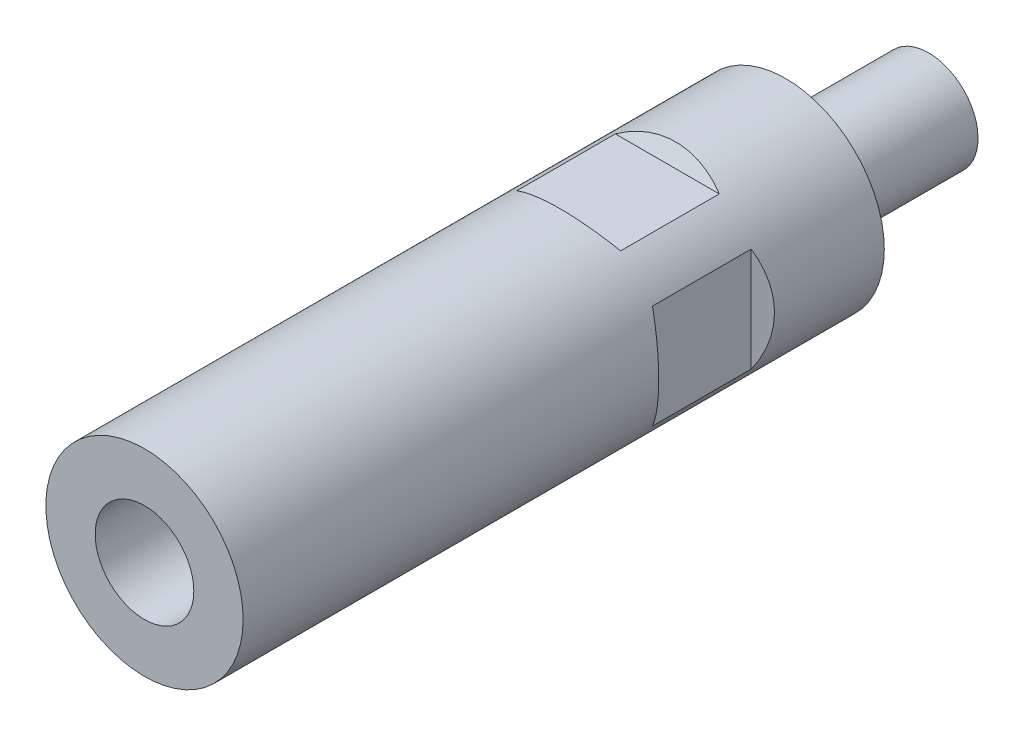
ISO-10303-21;
HEADER;
FILE_DESCRIPTION(('STEP AP214'),'2;1');
FILE_NAME('part.step','',(''),(''),'','','');
FILE_SCHEMA(('AUTOMOTIVE_DESIGN { 1 0 10303 214 1 1 1 1 }'));
ENDSEC;
DATA;
#1=APPLICATION_CONTEXT('core data for automotive mechanical design processes');
#2=APPLICATION_PROTOCOL_DEFINITION('international standard','automotive_design',2000,#1);
#3=PRODUCT_CONTEXT('',#1,'mechanical');
#4=PRODUCT('Part','Part','',(#3));
#5=PRODUCT_RELATED_PRODUCT_CATEGORY('part','',(#4));
#6=PRODUCT_DEFINITION_FORMATION('','',#4);
#7=PRODUCT_DEFINITION_CONTEXT('part definition',#1,'design');
#8=PRODUCT_DEFINITION('design','',#6,#7);
#9=PRODUCT_DEFINITION_SHAPE('','',#8);
#10=(LENGTH_UNIT() NAMED_UNIT(*) SI_UNIT(.MILLI.,.METRE.));
#11=(NAMED_UNIT(*) PLANE_ANGLE_UNIT() SI_UNIT($,.RADIAN.));
#12=(NAMED_UNIT(*) SI_UNIT($,.STERADIAN.) SOLID_ANGLE_UNIT());
#13=UNCERTAINTY_MEASURE_WITH_UNIT(LENGTH_MEASURE(1.E-05),#10,'distance_accuracy_value','');
#14=(GEOMETRIC_REPRESENTATION_CONTEXT(3) GLOBAL_UNCERTAINTY_ASSIGNED_CONTEXT((#13)) GLOBAL_UNIT_ASSIGNED_CONTEXT((#10,
#11,#12)) REPRESENTATION_CONTEXT('',''));
#15=CARTESIAN_POINT('',(0.,0.,0.));
#16=DIRECTION('',(0.,0.,1.));
#17=DIRECTION('',(1.,0.,0.));
#18=AXIS2_PLACEMENT_3D('',#15,#16,#17);
#19=CARTESIAN_POINT('',(0.,0.,5.5));
#20=DIRECTION('',(0.,0.,1.));
#21=DIRECTION('',(0.,-1.,0.));
#22=AXIS2_PLACEMENT_3D('',#19,#20,#21);
#23=CYLINDRICAL_SURFACE('',#22,5.);
#24=CARTESIAN_POINT('',(0.,0.,-14.5));
#25=DIRECTION('',(0.,0.,1.));
#26=DIRECTION('',(0.,-1.,0.));
#27=AXIS2_PLACEMENT_3D('',#24,#25,#26);
#28=CIRCLE('',#27,5.);
#29=CARTESIAN_POINT('',(0.,-5.,-14.5));
#30=VERTEX_POINT('',#29);
#31=EDGE_CURVE('E22',#30,#30,#28,.F.);
#32=ORIENTED_EDGE('',*,*,#31,.F.);
#33=EDGE_LOOP('',(#32));
#34=FACE_BOUND('',#33,.T.);
#35=CARTESIAN_POINT('',(0.,0.,0.));
#36=DIRECTION('',(0.,0.,1.));
#37=DIRECTION('',(1.,0.,0.));
#38=AXIS2_PLACEMENT_3D('',#35,#36,#37);
#39=CIRCLE('',#38,5.);
#40=CARTESIAN_POINT('',(5.,0.,0.));
#41=VERTEX_POINT('',#40);
#42=EDGE_CURVE('E9',#41,#41,#39,.T.);
#43=ORIENTED_EDGE('',*,*,#42,.F.);
#44=EDGE_LOOP('',(#43));
#45=FACE_BOUND('',#44,.T.);
#46=ADVANCED_FACE('F14',(#34,#45),#23,.T.);
#47=CARTESIAN_POINT('',(0.,0.,-14.5));
#48=DIRECTION('',(0.,0.,1.));
#49=DIRECTION('',(0.,-1.,0.));
#50=AXIS2_PLACEMENT_3D('',#47,#48,#49);
#51=PLANE('',#50);
#52=ORIENTED_EDGE('',*,*,#31,.T.);
#53=EDGE_LOOP('',(#52));
#54=FACE_BOUND('',#53,.T.);
#55=ADVANCED_FACE('F16',(#54),#51,.F.);
#56=CARTESIAN_POINT('',(4.25,4.36432032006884E-13,40.));
#57=DIRECTION('',(0.,0.,-1.));
#58=DIRECTION('',(-1.,0.,0.));
#59=AXIS2_PLACEMENT_3D('',#56,#57,#58);
#60=PLANE('',#59);
#61=CARTESIAN_POINT('',(0.,4.36432032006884E-13,40.));
#62=DIRECTION('',(0.,0.,1.));
#63=DIRECTION('',(1.,0.,0.));
#64=AXIS2_PLACEMENT_3D('',#61,#62,#63);
#65=CIRCLE('',#64,5.);
#66=CARTESIAN_POINT('',(5.,4.36432032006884E-13,40.));
#67=VERTEX_POINT('',#66);
#68=EDGE_CURVE('E251',#67,#67,#65,.T.);
#69=ORIENTED_EDGE('',*,*,#68,.T.);
#70=EDGE_LOOP('',(#69));
#71=FACE_BOUND('',#70,.T.);
#72=ADVANCED_FACE('F125',(#71),#60,.F.);
#73=CARTESIAN_POINT('',(0.,4.36432032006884E-13,65.));
#74=DIRECTION('',(0.,0.,1.));
#75=DIRECTION('',(1.,0.,0.));
#76=AXIS2_PLACEMENT_3D('',#73,#74,#75);
#77=CYLINDRICAL_SURFACE('',#76,5.);
#78=ORIENTED_EDGE('',*,*,#68,.F.);
#79=EDGE_LOOP('',(#78));
#80=FACE_BOUND('',#79,.T.);
#81=CARTESIAN_POINT('',(0.,4.36432032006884E-13,65.));
#82=DIRECTION('',(0.,0.,1.));
#83=DIRECTION('',(1.,0.,0.));
#84=AXIS2_PLACEMENT_3D('',#81,#82,#83);
#85=CIRCLE('',#84,5.);
#86=CARTESIAN_POINT('',(5.,4.36432032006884E-13,65.));
#87=VERTEX_POINT('',#86);
#88=EDGE_CURVE('E96',#87,#87,#85,.T.);
#89=ORIENTED_EDGE('',*,*,#88,.T.);
#90=EDGE_LOOP('',(#89));
#91=FACE_BOUND('',#90,.T.);
#92=ADVANCED_FACE('F127',(#80,#91),#77,.F.);
#93=CARTESIAN_POINT('',(0.,0.,65.));
#94=DIRECTION('',(0.,0.,1.));
#95=DIRECTION('',(1.,0.,0.));
#96=AXIS2_PLACEMENT_3D('',#93,#94,#95);
#97=PLANE('',#96);
#98=ORIENTED_EDGE('',*,*,#88,.F.);
#99=EDGE_LOOP('',(#98));
#100=FACE_BOUND('',#99,.T.);
#101=CARTESIAN_POINT('',(0.,0.,65.));
#102=DIRECTION('',(0.,0.,1.));
#103=DIRECTION('',(1.,0.,0.));
#104=AXIS2_PLACEMENT_3D('',#101,#102,#103);
#105=CIRCLE('',#104,10.);
#106=CARTESIAN_POINT('',(10.,0.,65.));
#107=VERTEX_POINT('',#106);
#108=EDGE_CURVE('E239',#107,#107,#105,.T.);
#109=ORIENTED_EDGE('',*,*,#108,.T.);
#110=EDGE_LOOP('',(#109));
#111=FACE_BOUND('',#110,.T.);
#112=ADVANCED_FACE('F134',(#100,#111),#97,.T.);
#113=CARTESIAN_POINT('',(8.5,-10.,22.));
#114=DIRECTION('',(-0.5,0.,0.866025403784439));
#115=DIRECTION('',(0.866025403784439,0.,0.5));
#116=AXIS2_PLACEMENT_3D('',#113,#114,#115);
#117=PLANE('',#116);
#118=DIRECTION('',(0.,1.,0.));
#119=VECTOR('',#118,1.);
#120=CARTESIAN_POINT('',(8.5,-10.,22.));
#121=LINE('',#120,#119);
#122=CARTESIAN_POINT('',(8.5,-5.26782687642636,22.));
#123=VERTEX_POINT('',#122);
#124=CARTESIAN_POINT('',(8.5,5.26782687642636,22.));
#125=VERTEX_POINT('',#124);
#126=EDGE_CURVE('E183',#123,#125,#121,.T.);
#127=ORIENTED_EDGE('',*,*,#126,.T.);
#128=CARTESIAN_POINT('',(0.,0.,17.0925227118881));
#129=DIRECTION('',(-0.5,0.,0.866025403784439));
#130=DIRECTION('',(-0.866025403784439,0.,-0.5));
#131=AXIS2_PLACEMENT_3D('',#128,#129,#130);
#132=ELLIPSE('',#131,11.5470053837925,10.);
#133=EDGE_CURVE('E35',#123,#125,#132,.T.);
#134=ORIENTED_EDGE('',*,*,#133,.F.);
#135=EDGE_LOOP('',(#127,#134));
#136=FACE_BOUND('',#135,.T.);
#137=ADVANCED_FACE('F175',(#136),#117,.F.);
#138=CARTESIAN_POINT('',(8.5,-10.,22.));
#139=DIRECTION('',(-1.,0.,0.));
#140=DIRECTION('',(0.,0.,1.));
#141=AXIS2_PLACEMENT_3D('',#138,#139,#140);
#142=PLANE('',#141);
#143=ORIENTED_EDGE('',*,*,#126,.F.);
#144=DIRECTION('',(0.,0.,-1.));
#145=VECTOR('',#144,1.);
#146=CARTESIAN_POINT('',(8.5,-5.26782687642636,65.));
#147=LINE('',#146,#145);
#148=CARTESIAN_POINT('',(8.5,-5.26782687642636,12.));
#149=VERTEX_POINT('',#148);
#150=EDGE_CURVE('E191',#149,#123,#147,.F.);
#151=ORIENTED_EDGE('',*,*,#150,.F.);
#152=DIRECTION('',(0.,1.,0.));
#153=VECTOR('',#152,1.);
#154=CARTESIAN_POINT('',(8.5,-10.,12.));
#155=LINE('',#154,#153);
#156=CARTESIAN_POINT('',(8.5,5.26782687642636,12.));
#157=VERTEX_POINT('',#156);
#158=EDGE_CURVE('E187',#149,#157,#155,.T.);
#159=ORIENTED_EDGE('',*,*,#158,.T.);
#160=DIRECTION('',(0.,0.,-1.));
#161=VECTOR('',#160,1.);
#162=CARTESIAN_POINT('',(8.5,5.26782687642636,65.));
#163=LINE('',#162,#161);
#164=EDGE_CURVE('E29',#125,#157,#163,.T.);
#165=ORIENTED_EDGE('',*,*,#164,.F.);
#166=EDGE_LOOP('',(#143,#151,#159,#165));
#167=FACE_BOUND('',#166,.T.);
#168=ADVANCED_FACE('F172',(#167),#142,.F.);
#169=CARTESIAN_POINT('',(8.5,-10.,12.));
#170=DIRECTION('',(-0.5,0.,-0.866025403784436));
#171=DIRECTION('',(-0.866025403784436,0.,0.5));
#172=AXIS2_PLACEMENT_3D('',#169,#170,#171);
#173=PLANE('',#172);
#174=CARTESIAN_POINT('',(0.,0.,16.9074772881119));
#175=DIRECTION('',(-0.5,0.,-0.866025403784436));
#176=DIRECTION('',(0.866025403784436,0.,-0.5));
#177=AXIS2_PLACEMENT_3D('',#174,#175,#176);
#178=ELLIPSE('',#177,11.5470053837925,10.);
#179=EDGE_CURVE('E195',#157,#149,#178,.T.);
#180=ORIENTED_EDGE('',*,*,#179,.F.);
#181=ORIENTED_EDGE('',*,*,#158,.F.);
#182=EDGE_LOOP('',(#180,#181));
#183=FACE_BOUND('',#182,.T.);
#184=ADVANCED_FACE('F167',(#183),#173,.F.);
#185=CARTESIAN_POINT('',(-8.5,-10.,12.));
#186=DIRECTION('',(0.5,0.,-0.866025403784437));
#187=DIRECTION('',(-0.866025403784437,0.,-0.5));
#188=AXIS2_PLACEMENT_3D('',#185,#186,#187);
#189=PLANE('',#188);
#190=CARTESIAN_POINT('',(0.,0.,16.9074772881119));
#191=DIRECTION('',(0.5,0.,-0.866025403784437));
#192=DIRECTION('',(-0.866025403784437,0.,-0.5));
#193=AXIS2_PLACEMENT_3D('',#190,#191,#192);
#194=ELLIPSE('',#193,11.5470053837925,10.);
#195=CARTESIAN_POINT('',(-8.5,-5.26782687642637,12.));
#196=VERTEX_POINT('',#195);
#197=CARTESIAN_POINT('',(-8.5,5.26782687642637,12.));
#198=VERTEX_POINT('',#197);
#199=EDGE_CURVE('E193',#196,#198,#194,.T.);
#200=ORIENTED_EDGE('',*,*,#199,.F.);
#201=DIRECTION('',(0.,1.,0.));
#202=VECTOR('',#201,1.);
#203=CARTESIAN_POINT('',(-8.5,-10.,12.));
#204=LINE('',#203,#202);
#205=EDGE_CURVE('E227',#196,#198,#204,.T.);
#206=ORIENTED_EDGE('',*,*,#205,.T.);
#207=EDGE_LOOP('',(#200,#206));
#208=FACE_BOUND('',#207,.T.);
#209=ADVANCED_FACE('F163',(#208),#189,.F.);
#210=CARTESIAN_POINT('',(-8.5,-10.,22.));
#211=DIRECTION('',(0.5,0.,0.866025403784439));
#212=DIRECTION('',(0.866025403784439,0.,-0.5));
#213=AXIS2_PLACEMENT_3D('',#210,#211,#212);
#214=PLANE('',#213);
#215=DIRECTION('',(0.,1.,0.));
#216=VECTOR('',#215,1.);
#217=CARTESIAN_POINT('',(-8.5,-10.,22.));
#218=LINE('',#217,#216);
#219=CARTESIAN_POINT('',(-8.5,-5.26782687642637,22.));
#220=VERTEX_POINT('',#219);
#221=CARTESIAN_POINT('',(-8.5,5.26782687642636,22.));
#222=VERTEX_POINT('',#221);
#223=EDGE_CURVE('E231',#220,#222,#218,.T.);
#224=ORIENTED_EDGE('',*,*,#223,.F.);
#225=CARTESIAN_POINT('',(0.,0.,17.0925227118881));
#226=DIRECTION('',(0.5,0.,0.866025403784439));
#227=DIRECTION('',(0.866025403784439,0.,-0.5));
#228=AXIS2_PLACEMENT_3D('',#225,#226,#227);
#229=ELLIPSE('',#228,11.5470053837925,10.);
#230=EDGE_CURVE('E206',#222,#220,#229,.T.);
#231=ORIENTED_EDGE('',*,*,#230,.F.);
#232=EDGE_LOOP('',(#224,#231));
#233=FACE_BOUND('',#232,.T.);
#234=ADVANCED_FACE('F160',(#233),#214,.F.);
#235=CARTESIAN_POINT('',(-8.5,-10.,22.));
#236=DIRECTION('',(1.,0.,0.));
#237=DIRECTION('',(0.,0.,-1.));
#238=AXIS2_PLACEMENT_3D('',#235,#236,#237);
#239=PLANE('',#238);
#240=ORIENTED_EDGE('',*,*,#223,.T.);
#241=DIRECTION('',(0.,0.,-1.));
#242=VECTOR('',#241,1.);
#243=CARTESIAN_POINT('',(-8.5,5.2678268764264,65.));
#244=LINE('',#243,#242);
#245=EDGE_CURVE('E200',#198,#222,#244,.F.);
#246=ORIENTED_EDGE('',*,*,#245,.F.);
#247=ORIENTED_EDGE('',*,*,#205,.F.);
#248=DIRECTION('',(0.,0.,-1.));
#249=VECTOR('',#248,1.);
#250=CARTESIAN_POINT('',(-8.5,-5.2678268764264,65.));
#251=LINE('',#250,#249);
#252=EDGE_CURVE('E203',#220,#196,#251,.T.);
#253=ORIENTED_EDGE('',*,*,#252,.F.);
#254=EDGE_LOOP('',(#240,#246,#247,#253));
#255=FACE_BOUND('',#254,.T.);
#256=ADVANCED_FACE('F158',(#255),#239,.F.);
#257=CARTESIAN_POINT('',(10.,8.5,22.));
#258=DIRECTION('',(0.,-0.5,0.866025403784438));
#259=DIRECTION('',(0.,-0.866025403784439,-0.5));
#260=AXIS2_PLACEMENT_3D('',#257,#258,#259);
#261=PLANE('',#260);
#262=DIRECTION('',(-1.,0.,0.));
#263=VECTOR('',#262,1.);
#264=CARTESIAN_POINT('',(10.,8.5,22.));
#265=LINE('',#264,#263);
#266=CARTESIAN_POINT('',(5.26782687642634,8.5,22.));
#267=VERTEX_POINT('',#266);
#268=CARTESIAN_POINT('',(-5.26782687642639,8.5,22.));
#269=VERTEX_POINT('',#268);
#270=EDGE_CURVE('E225',#267,#269,#265,.T.);
#271=ORIENTED_EDGE('',*,*,#270,.T.);
#272=CARTESIAN_POINT('',(0.,0.,17.0925227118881));
#273=DIRECTION('',(0.,-0.5,0.866025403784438));
#274=DIRECTION('',(0.,-0.866025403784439,-0.5));
#275=AXIS2_PLACEMENT_3D('',#272,#273,#274);
#276=ELLIPSE('',#275,11.5470053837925,10.);
#277=EDGE_CURVE('E214',#267,#269,#276,.T.);
#278=ORIENTED_EDGE('',*,*,#277,.F.);
#279=EDGE_LOOP('',(#271,#278));
#280=FACE_BOUND('',#279,.T.);
#281=ADVANCED_FACE('F151',(#280),#261,.F.);
#282=CARTESIAN_POINT('',(10.,8.5,22.));
#283=DIRECTION('',(0.,-1.,0.));
#284=DIRECTION('',(1.,0.,0.));
#285=AXIS2_PLACEMENT_3D('',#282,#283,#284);
#286=PLANE('',#285);
#287=ORIENTED_EDGE('',*,*,#270,.F.);
#288=DIRECTION('',(0.,0.,-1.));
#289=VECTOR('',#288,1.);
#290=CARTESIAN_POINT('',(5.26782687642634,8.5,65.));
#291=LINE('',#290,#289);
#292=CARTESIAN_POINT('',(5.26782687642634,8.5,12.));
#293=VERTEX_POINT('',#292);
#294=EDGE_CURVE('E88',#293,#267,#291,.F.);
#295=ORIENTED_EDGE('',*,*,#294,.F.);
#296=DIRECTION('',(-1.,0.,0.));
#297=VECTOR('',#296,1.);
#298=CARTESIAN_POINT('',(10.,8.5,12.));
#299=LINE('',#298,#297);
#300=CARTESIAN_POINT('',(-5.26782687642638,8.5,12.));
#301=VERTEX_POINT('',#300);
#302=EDGE_CURVE('E223',#293,#301,#299,.T.);
#303=ORIENTED_EDGE('',*,*,#302,.T.);
#304=DIRECTION('',(0.,0.,-1.));
#305=VECTOR('',#304,1.);
#306=CARTESIAN_POINT('',(-5.2678268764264,8.5,65.));
#307=LINE('',#306,#305);
#308=EDGE_CURVE('E211',#269,#301,#307,.T.);
#309=ORIENTED_EDGE('',*,*,#308,.F.);
#310=EDGE_LOOP('',(#287,#295,#303,#309));
#311=FACE_BOUND('',#310,.T.);
#312=ADVANCED_FACE('F148',(#311),#286,.F.);
#313=CARTESIAN_POINT('',(10.,8.5,12.));
#314=DIRECTION('',(0.,-0.5,-0.866025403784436));
#315=DIRECTION('',(0.,0.866025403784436,-0.5));
#316=AXIS2_PLACEMENT_3D('',#313,#314,#315);
#317=PLANE('',#316);
#318=CARTESIAN_POINT('',(0.,0.,16.9074772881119));
#319=DIRECTION('',(0.,-0.5,-0.866025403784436));
#320=DIRECTION('',(0.,0.866025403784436,-0.5));
#321=AXIS2_PLACEMENT_3D('',#318,#319,#320);
#322=ELLIPSE('',#321,11.5470053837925,10.);
#323=EDGE_CURVE('E209',#301,#293,#322,.T.);
#324=ORIENTED_EDGE('',*,*,#323,.F.);
#325=ORIENTED_EDGE('',*,*,#302,.F.);
#326=EDGE_LOOP('',(#324,#325));
#327=FACE_BOUND('',#326,.T.);
#328=ADVANCED_FACE('F145',(#327),#317,.F.);
#329=CARTESIAN_POINT('',(10.,-8.5,12.));
#330=DIRECTION('',(0.,0.5,-0.866025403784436));
#331=DIRECTION('',(0.,0.866025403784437,0.5));
#332=AXIS2_PLACEMENT_3D('',#329,#330,#331);
#333=PLANE('',#332);
#334=CARTESIAN_POINT('',(0.,0.,16.9074772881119));
#335=DIRECTION('',(0.,0.5,-0.866025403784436));
#336=DIRECTION('',(0.,-0.866025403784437,-0.5));
#337=AXIS2_PLACEMENT_3D('',#334,#335,#336);
#338=ELLIPSE('',#337,11.5470053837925,10.);
#339=CARTESIAN_POINT('',(5.26782687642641,-8.5,12.));
#340=VERTEX_POINT('',#339);
#341=CARTESIAN_POINT('',(-5.26782687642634,-8.5,12.));
#342=VERTEX_POINT('',#341);
#343=EDGE_CURVE('E79',#340,#342,#338,.T.);
#344=ORIENTED_EDGE('',*,*,#343,.F.);
#345=DIRECTION('',(-1.,0.,0.));
#346=VECTOR('',#345,1.);
#347=CARTESIAN_POINT('',(10.,-8.5,12.));
#348=LINE('',#347,#346);
#349=EDGE_CURVE('E82',#340,#342,#348,.T.);
#350=ORIENTED_EDGE('',*,*,#349,.T.);
#351=EDGE_LOOP('',(#344,#350));
#352=FACE_BOUND('',#351,.T.);
#353=ADVANCED_FACE('F81',(#352),#333,.F.);
#354=CARTESIAN_POINT('',(10.,-8.5,22.));
#355=DIRECTION('',(0.,0.5,0.866025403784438));
#356=DIRECTION('',(0.,-0.866025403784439,0.5));
#357=AXIS2_PLACEMENT_3D('',#354,#355,#356);
#358=PLANE('',#357);
#359=DIRECTION('',(-1.,0.,0.));
#360=VECTOR('',#359,1.);
#361=CARTESIAN_POINT('',(10.,-8.5,22.));
#362=LINE('',#361,#360);
#363=CARTESIAN_POINT('',(5.26782687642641,-8.5,22.));
#364=VERTEX_POINT('',#363);
#365=CARTESIAN_POINT('',(-5.26782687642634,-8.5,22.));
#366=VERTEX_POINT('',#365);
#367=EDGE_CURVE('E95',#364,#366,#362,.T.);
#368=ORIENTED_EDGE('',*,*,#367,.F.);
#369=CARTESIAN_POINT('',(0.,0.,17.0925227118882));
#370=DIRECTION('',(0.,0.5,0.866025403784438));
#371=DIRECTION('',(0.,0.866025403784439,-0.5));
#372=AXIS2_PLACEMENT_3D('',#369,#370,#371);
#373=ELLIPSE('',#372,11.5470053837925,10.);
#374=EDGE_CURVE('E101',#366,#364,#373,.T.);
#375=ORIENTED_EDGE('',*,*,#374,.F.);
#376=EDGE_LOOP('',(#368,#375));
#377=FACE_BOUND('',#376,.T.);
#378=ADVANCED_FACE('F139',(#377),#358,.F.);
#379=CARTESIAN_POINT('',(10.,-8.5,22.));
#380=DIRECTION('',(0.,1.,0.));
#381=DIRECTION('',(-1.,0.,0.));
#382=AXIS2_PLACEMENT_3D('',#379,#380,#381);
#383=PLANE('',#382);
#384=ORIENTED_EDGE('',*,*,#367,.T.);
#385=DIRECTION('',(0.,0.,-1.));
#386=VECTOR('',#385,1.);
#387=CARTESIAN_POINT('',(-5.26782687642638,-8.5,65.));
#388=LINE('',#387,#386);
#389=EDGE_CURVE('E87',#342,#366,#388,.F.);
#390=ORIENTED_EDGE('',*,*,#389,.F.);
#391=ORIENTED_EDGE('',*,*,#349,.F.);
#392=DIRECTION('',(0.,0.,-1.));
#393=VECTOR('',#392,1.);
#394=CARTESIAN_POINT('',(5.26782687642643,-8.5,65.));
#395=LINE('',#394,#393);
#396=EDGE_CURVE('E93',#364,#340,#395,.T.);
#397=ORIENTED_EDGE('',*,*,#396,.F.);
#398=EDGE_LOOP('',(#384,#390,#391,#397));
#399=FACE_BOUND('',#398,.T.);
#400=ADVANCED_FACE('F92',(#399),#383,.F.);
#401=CARTESIAN_POINT('',(0.,0.,65.));
#402=DIRECTION('',(0.,0.,-1.));
#403=DIRECTION('',(-1.,0.,0.));
#404=AXIS2_PLACEMENT_3D('',#401,#402,#403);
#405=CYLINDRICAL_SURFACE('',#404,10.);
#406=ORIENTED_EDGE('',*,*,#389,.T.);
#407=ORIENTED_EDGE('',*,*,#374,.T.);
#408=ORIENTED_EDGE('',*,*,#396,.T.);
#409=ORIENTED_EDGE('',*,*,#343,.T.);
#410=EDGE_LOOP('',(#406,#407,#408,#409));
#411=FACE_BOUND('',#410,.T.);
#412=ORIENTED_EDGE('',*,*,#323,.T.);
#413=ORIENTED_EDGE('',*,*,#294,.T.);
#414=ORIENTED_EDGE('',*,*,#277,.T.);
#415=ORIENTED_EDGE('',*,*,#308,.T.);
#416=EDGE_LOOP('',(#412,#413,#414,#415));
#417=FACE_BOUND('',#416,.T.);
#418=ORIENTED_EDGE('',*,*,#245,.T.);
#419=ORIENTED_EDGE('',*,*,#230,.T.);
#420=ORIENTED_EDGE('',*,*,#252,.T.);
#421=ORIENTED_EDGE('',*,*,#199,.T.);
#422=EDGE_LOOP('',(#418,#419,#420,#421));
#423=FACE_BOUND('',#422,.T.);
#424=ORIENTED_EDGE('',*,*,#179,.T.);
#425=ORIENTED_EDGE('',*,*,#150,.T.);
#426=ORIENTED_EDGE('',*,*,#133,.T.);
#427=ORIENTED_EDGE('',*,*,#164,.T.);
#428=EDGE_LOOP('',(#424,#425,#426,#427));
#429=FACE_BOUND('',#428,.T.);
#430=ORIENTED_EDGE('',*,*,#108,.F.);
#431=EDGE_LOOP('',(#430));
#432=FACE_BOUND('',#431,.T.);
#433=CARTESIAN_POINT('',(0.,0.,0.));
#434=DIRECTION('',(0.,0.,1.));
#435=DIRECTION('',(1.,0.,0.));
#436=AXIS2_PLACEMENT_3D('',#433,#434,#435);
#437=CIRCLE('',#436,10.);
#438=CARTESIAN_POINT('',(10.,0.,0.));
#439=VERTEX_POINT('',#438);
#440=EDGE_CURVE('E186',#439,#439,#437,.T.);
#441=ORIENTED_EDGE('',*,*,#440,.T.);
#442=EDGE_LOOP('',(#441));
#443=FACE_BOUND('',#442,.T.);
#444=ADVANCED_FACE('F99',(#411,#417,#423,#429,#432,#443),#405,.T.);
#445=CARTESIAN_POINT('',(0.,0.,0.));
#446=DIRECTION('',(0.,0.,1.));
#447=DIRECTION('',(1.,0.,0.));
#448=AXIS2_PLACEMENT_3D('',#445,#446,#447);
#449=PLANE('',#448);
#450=ORIENTED_EDGE('',*,*,#440,.F.);
#451=EDGE_LOOP('',(#450));
#452=FACE_BOUND('',#451,.T.);
#453=ORIENTED_EDGE('',*,*,#42,.T.);
#454=EDGE_LOOP('',(#453));
#455=FACE_BOUND('',#454,.T.);
#456=ADVANCED_FACE('F111',(#452,#455),#449,.F.);
#457=CLOSED_SHELL('',(#46,#55,#72,#92,#112,#137,#168,#184,#209,#234,#256,#281,#312,#328,#353,
#378,#400,#444,#456));
#458=MANIFOLD_SOLID_BREP('B1',#457);
#459=ADVANCED_BREP_SHAPE_REPRESENTATION('',(#18,#458),#14);
#460=SHAPE_DEFINITION_REPRESENTATION(#9,#459);
ENDSEC;
END-ISO-10303-21;
